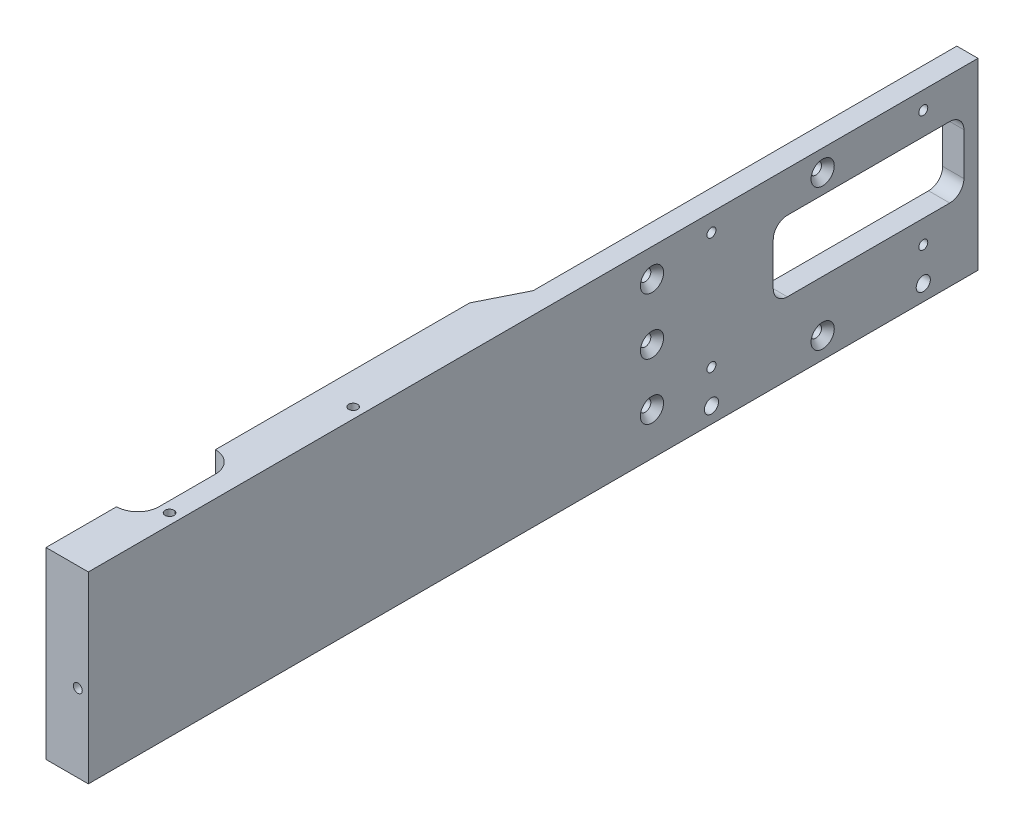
from build123d import *

# Parameters (mm, degrees)
SKETCH1_W                                          = 209.55
SKETCH1_H                                          = 82.55635
EXTRUDE1_DEPTH                                     = 9.525
SLOT_DEPTH                                         = 404.082005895
EXTRUDE2_REACH                                     = 415.327
EXTRUDE2_DIRECTION_2_REACH                         = 415.327
SKETCH17_W                                         = 19.05
SKETCH17_H                                         = 82.55635
BOSS_EXTRUDE1_DEPTH                                = 190.5
SKETCH14_R                                         = 2.0193
CTD_HOLES_DEPTH                                    = 404.082005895
F_1_4_0_25_DIAMETER_HOLE1_D                        = 6.35
F_10_32_TAPPED_HOLE2_D                             = 4.0386
F_10_32_TAPPED_HOLE2_DEPTH                         = 12.7
F_10_32_TAPPED_HOLE2_TIP                           = 1.213317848
F_10_32_TAPPED_HOLE3_D                             = 4.0386
F_10_32_TAPPED_HOLE3_DEPTH                         = 22.225
F_10_32_TAPPED_HOLE3_TIP                           = 1.213317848
CUT_EXTRUDE1_DEPTH                                 = 419.700356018
CSK_FOR_10_FLAT_HEAD_SOCKET_CAP_SCREW1_D           = 5.1054
CSK_FOR_10_FLAT_HEAD_SOCKET_CAP_SCREW1_CSINK_D     = 10.4394
CSK_FOR_10_FLAT_HEAD_SOCKET_CAP_SCREW1_CSINK_ANGLE = 82


with BuildPart() as part:
    # Sketch1 → Extrude1 (new body)
    with BuildSketch(Plane(origin=(91.948, 0, 0), x_dir=(0, 0, -1), z_dir=(1, 0, 0))):
        with Locations((295.275, -7.140575)):
            Rectangle(SKETCH1_W, SKETCH1_H)
    extrude(amount=-EXTRUDE1_DEPTH)

    # Sketch3 → Slot (cut, through all)
    with BuildSketch(Plane.ZY.offset(-82.423)):
        with BuildLine():
            Line((-314.325, -15.875), (-387.35, -15.875))
            ThreePointArc((-387.35, -15.875), (-391.840128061, -14.015128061), (-393.7, -9.525))
            Line((-393.7, -9.525), (-393.7, 9.525))
            ThreePointArc((-393.7, 9.525), (-391.840128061, 14.015128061), (-387.35, 15.875))
            Line((-387.35, 15.875), (-314.325, 15.875))
            ThreePointArc((-314.325, 15.875), (-309.834871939, 14.015128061), (-307.975, 9.525))
            Line((-307.975, 9.525), (-307.975, -9.525))
            ThreePointArc((-307.975, -9.525), (-309.834871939, -14.015128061), (-314.325, -15.875))
        make_face()
    extrude(amount=-SLOT_DEPTH, mode=Mode.SUBTRACT)

    # Extrude2: up to this face of the body (flat: up to its plane)
    extrude2_end = Plane(part.part.faces().sort_by_distance((87.1855, 34.1376, -295.275))[0])
    # Sketch7 → Extrude2 (add, up to the picked face)
    with BuildSketch(Plane(origin=(0, 0, 0), x_dir=(1, 0, 0), z_dir=(0, 1, 0)), mode=Mode.PRIVATE) as extrude2_sk1:
        Polygon((82.423, 190.5), (82.423, 209.55), (72.898, 190.5), align=None)
    extrude2_tool1 = split(extrude(extrude2_sk1.sketch, amount=EXTRUDE2_REACH, mode=Mode.PRIVATE), bisect_by=extrude2_end, keep=Keep.BOTH, mode=Mode.PRIVATE)
    add(extrude2_tool1.solids().sort_by(Axis((79.248, 0, -196.85), (0, 1, 0)))[0])

    # Extrude2 direction 2: up to this face of the body (flat: up to its plane)
    extrude2_direction_2_end = Plane(part.part.faces().sort_by_distance((87.1855, -48.41875, -295.275))[0])
    # Sketch7 → Extrude2 direction 2 (add, up to the picked face)
    with BuildSketch(Plane(origin=(0, 0, 0), x_dir=(1, 0, 0), z_dir=(0, 1, 0)), mode=Mode.PRIVATE) as extrude2_direction_2_sk1:
        Polygon((82.423, 190.5), (82.423, 209.55), (72.898, 190.5), align=None)
    extrude2_direction_2_tool1 = split(extrude(extrude2_direction_2_sk1.sketch, amount=-EXTRUDE2_DIRECTION_2_REACH, mode=Mode.PRIVATE), bisect_by=extrude2_direction_2_end, keep=Keep.BOTH, mode=Mode.PRIVATE)
    add(extrude2_direction_2_tool1.solids().sort_by(Axis((79.248, 0, -196.85), (0, -1, 0)))[0])

    # Sketch17 → Boss-Extrude1 (add)
    with BuildSketch(Plane.XY.offset(-190.5)):
        with Locations((82.423, -7.140575)):
            Rectangle(SKETCH17_W, SKETCH17_H)
    extrude(amount=BOSS_EXTRUDE1_DEPTH)

    # Sketch14 → CTD Holes (cut, through all)
    with BuildSketch(Plane.ZY.offset(-82.423)):
        with Locations((-375.44375, 26.2001)):
            Circle(SKETCH14_R)
        with Locations((-375.44375, -26.1874)):
            Circle(SKETCH14_R)
        with Locations((-280.19375, 26.2001)):
            Circle(SKETCH14_R)
        with Locations((-280.19375, -26.1874)):
            Circle(SKETCH14_R)
    extrude(amount=-CTD_HOLES_DEPTH, mode=Mode.SUBTRACT)

    # 1_4 _0.25_ Diameter Hole1 (through all)
    with Locations(Plane(origin=(91.948, 0, 0), x_dir=(0, 0, -1), z_dir=(1, 0, 0))):
        with Locations((280.19375, -41.275), (375.44375, -41.275)):
            Hole(F_1_4_0_25_DIAMETER_HOLE1_D / 2)

    # 10-32 Tapped Hole2
    with Locations(Plane(origin=(0, 34.1376, 0), x_dir=(-1, 0, 0), z_dir=(0, 1, 0))):
        with Locations((-87.1855, -41.275), (-87.1855, -123.825)):
            Hole(F_10_32_TAPPED_HOLE2_D / 2, depth=F_10_32_TAPPED_HOLE2_DEPTH)
            with Locations((0, 0, -(F_10_32_TAPPED_HOLE2_DEPTH + F_10_32_TAPPED_HOLE2_TIP / 2))):  # 118° drill point
                Cone(0, F_10_32_TAPPED_HOLE2_D / 2, F_10_32_TAPPED_HOLE2_TIP, mode=Mode.SUBTRACT)

    # 10-32 Tapped Hole3
    with Locations(Plane(origin=(-5.311617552, 12.778757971, 0), x_dir=(1, 0, 0), z_dir=(0, 0, 1))):
        with Locations((92.497117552, -26.266157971)):
            Hole(F_10_32_TAPPED_HOLE3_D / 2, depth=F_10_32_TAPPED_HOLE3_DEPTH)
            with Locations((0, 0, -(F_10_32_TAPPED_HOLE3_DEPTH + F_10_32_TAPPED_HOLE3_TIP / 2))):  # 118° drill point
                Cone(0, F_10_32_TAPPED_HOLE3_D / 2, F_10_32_TAPPED_HOLE3_TIP, mode=Mode.SUBTRACT)

    # Sketch18 → Cut-Extrude1 (cut, through all)
    with BuildSketch(Plane.XZ.offset(-34.1376)):
        with BuildLine():
            Line((82.423, -66.675), (82.423, -41.275))
            ThreePointArc((82.423, -41.275), (79.633192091, -34.539807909), (72.898, -31.75))
            Line((72.898, -31.75), (72.898, -76.2))
            ThreePointArc((72.898, -76.2), (79.633192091, -73.410192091), (82.423, -66.675))
        make_face()
    extrude(amount=CUT_EXTRUDE1_DEPTH, mode=Mode.SUBTRACT)

    # CSK for _10 Flat Head Socket Cap Screw1 (through all)
    with Locations(Plane(origin=(91.948, 0, 0), x_dir=(0, 0, -1), z_dir=(1, 0, 0))):
        with Locations((253.4412, 21.4376), (253.4412, -3.9624), (330.2, -38.89375), (330.2, 24.6126), (253.4412, -29.3624)):
            CounterSinkHole(CSK_FOR_10_FLAT_HEAD_SOCKET_CAP_SCREW1_D / 2, CSK_FOR_10_FLAT_HEAD_SOCKET_CAP_SCREW1_CSINK_D / 2, counter_sink_angle=CSK_FOR_10_FLAT_HEAD_SOCKET_CAP_SCREW1_CSINK_ANGLE)


solid = part.part
